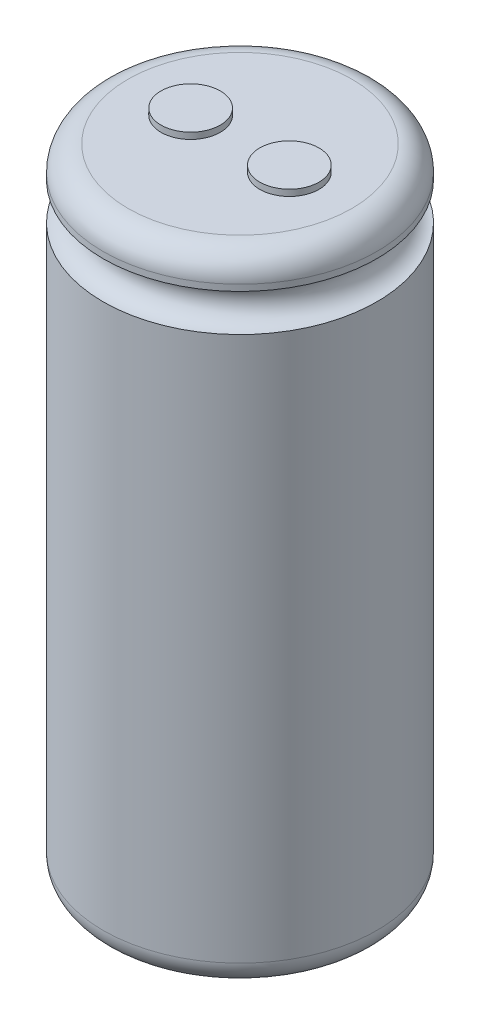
ISO-10303-21;
HEADER;
FILE_DESCRIPTION(('STEP AP214'),'2;1');
FILE_NAME('part.step','',(''),(''),'','','');
FILE_SCHEMA(('AUTOMOTIVE_DESIGN { 1 0 10303 214 1 1 1 1 }'));
ENDSEC;
DATA;
#1=APPLICATION_CONTEXT('core data for automotive mechanical design processes');
#2=APPLICATION_PROTOCOL_DEFINITION('international standard','automotive_design',2000,#1);
#3=PRODUCT_CONTEXT('',#1,'mechanical');
#4=PRODUCT('Part','Part','',(#3));
#5=PRODUCT_RELATED_PRODUCT_CATEGORY('part','',(#4));
#6=PRODUCT_DEFINITION_FORMATION('','',#4);
#7=PRODUCT_DEFINITION_CONTEXT('part definition',#1,'design');
#8=PRODUCT_DEFINITION('design','',#6,#7);
#9=PRODUCT_DEFINITION_SHAPE('','',#8);
#10=(LENGTH_UNIT() NAMED_UNIT(*) SI_UNIT(.MILLI.,.METRE.));
#11=(NAMED_UNIT(*) PLANE_ANGLE_UNIT() SI_UNIT($,.RADIAN.));
#12=(NAMED_UNIT(*) SI_UNIT($,.STERADIAN.) SOLID_ANGLE_UNIT());
#13=UNCERTAINTY_MEASURE_WITH_UNIT(LENGTH_MEASURE(1.E-05),#10,'distance_accuracy_value','');
#14=(GEOMETRIC_REPRESENTATION_CONTEXT(3) GLOBAL_UNCERTAINTY_ASSIGNED_CONTEXT((#13)) GLOBAL_UNIT_ASSIGNED_CONTEXT((#10,
#11,#12)) REPRESENTATION_CONTEXT('',''));
#15=CARTESIAN_POINT('',(0.,0.,0.));
#16=DIRECTION('',(0.,0.,1.));
#17=DIRECTION('',(1.,0.,0.));
#18=AXIS2_PLACEMENT_3D('',#15,#16,#17);
#19=CARTESIAN_POINT('',(0.,51.2572,-9.));
#20=DIRECTION('',(0.,-1.,0.));
#21=DIRECTION('',(0.,0.,-1.));
#22=AXIS2_PLACEMENT_3D('',#19,#20,#21);
#23=PLANE('',#22);
#24=CARTESIAN_POINT('',(3.96875,51.2572,0.));
#25=DIRECTION('',(0.,-1.,0.));
#26=DIRECTION('',(0.,0.,-1.));
#27=AXIS2_PLACEMENT_3D('',#24,#25,#26);
#28=CIRCLE('',#27,2.38125);
#29=CARTESIAN_POINT('',(3.96875,51.2572,-2.38125));
#30=VERTEX_POINT('',#29);
#31=EDGE_CURVE('E10',#30,#30,#28,.F.);
#32=ORIENTED_EDGE('',*,*,#31,.F.);
#33=EDGE_LOOP('',(#32));
#34=FACE_BOUND('',#33,.T.);
#35=CARTESIAN_POINT('',(-3.96875,51.2572,0.));
#36=DIRECTION('',(0.,-1.,0.));
#37=DIRECTION('',(0.,0.,-1.));
#38=AXIS2_PLACEMENT_3D('',#35,#36,#37);
#39=CIRCLE('',#38,2.38125);
#40=CARTESIAN_POINT('',(-3.96875,51.2572,-2.38125));
#41=VERTEX_POINT('',#40);
#42=EDGE_CURVE('E43',#41,#41,#39,.F.);
#43=ORIENTED_EDGE('',*,*,#42,.F.);
#44=EDGE_LOOP('',(#43));
#45=FACE_BOUND('',#44,.T.);
#46=CARTESIAN_POINT('',(0.,51.2572,0.));
#47=DIRECTION('',(0.,1.,0.));
#48=DIRECTION('',(0.,0.,1.));
#49=AXIS2_PLACEMENT_3D('',#46,#47,#48);
#50=CIRCLE('',#49,9.);
#51=CARTESIAN_POINT('',(0.,51.2572,9.));
#52=VERTEX_POINT('',#51);
#53=EDGE_CURVE('E49',#52,#52,#50,.T.);
#54=ORIENTED_EDGE('',*,*,#53,.T.);
#55=EDGE_LOOP('',(#54));
#56=FACE_BOUND('',#55,.T.);
#57=ADVANCED_FACE('F36',(#34,#45,#56),#23,.F.);
#58=CARTESIAN_POINT('',(0.,49.2572,0.));
#59=DIRECTION('',(0.,1.,0.));
#60=DIRECTION('',(0.,0.,1.));
#61=AXIS2_PLACEMENT_3D('',#58,#59,#60);
#62=TOROIDAL_SURFACE('',#61,9.,2.);
#63=ORIENTED_EDGE('',*,*,#53,.F.);
#64=EDGE_LOOP('',(#63));
#65=FACE_BOUND('',#64,.T.);
#66=CARTESIAN_POINT('',(0.,49.2572,0.));
#67=DIRECTION('',(0.,1.,0.));
#68=DIRECTION('',(0.,0.,1.));
#69=AXIS2_PLACEMENT_3D('',#66,#67,#68);
#70=CIRCLE('',#69,11.);
#71=CARTESIAN_POINT('',(0.,49.2572,11.));
#72=VERTEX_POINT('',#71);
#73=EDGE_CURVE('E53',#72,#72,#70,.T.);
#74=ORIENTED_EDGE('',*,*,#73,.T.);
#75=EDGE_LOOP('',(#74));
#76=FACE_BOUND('',#75,.T.);
#77=ADVANCED_FACE('F95',(#65,#76),#62,.T.);
#78=CARTESIAN_POINT('',(0.,51.2572,0.));
#79=DIRECTION('',(0.,1.,0.));
#80=DIRECTION('',(0.,0.,1.));
#81=AXIS2_PLACEMENT_3D('',#78,#79,#80);
#82=CYLINDRICAL_SURFACE('',#81,11.);
#83=ORIENTED_EDGE('',*,*,#73,.F.);
#84=EDGE_LOOP('',(#83));
#85=FACE_BOUND('',#84,.T.);
#86=CARTESIAN_POINT('',(0.,48.7572,0.));
#87=DIRECTION('',(0.,1.,0.));
#88=DIRECTION('',(0.,0.,1.));
#89=AXIS2_PLACEMENT_3D('',#86,#87,#88);
#90=CIRCLE('',#89,11.);
#91=CARTESIAN_POINT('',(0.,48.7572,11.));
#92=VERTEX_POINT('',#91);
#93=EDGE_CURVE('E59',#92,#92,#90,.T.);
#94=ORIENTED_EDGE('',*,*,#93,.T.);
#95=EDGE_LOOP('',(#94));
#96=FACE_BOUND('',#95,.T.);
#97=ADVANCED_FACE('F100',(#85,#96),#82,.T.);
#98=CARTESIAN_POINT('',(0.,47.2572,0.));
#99=DIRECTION('',(0.,1.,0.));
#100=DIRECTION('',(0.,0.,1.));
#101=AXIS2_PLACEMENT_3D('',#98,#99,#100);
#102=TOROIDAL_SURFACE('',#101,11.,1.5);
#103=ORIENTED_EDGE('',*,*,#93,.F.);
#104=EDGE_LOOP('',(#103));
#105=FACE_BOUND('',#104,.T.);
#106=CARTESIAN_POINT('',(0.,45.7572,0.));
#107=DIRECTION('',(0.,1.,0.));
#108=DIRECTION('',(0.,0.,1.));
#109=AXIS2_PLACEMENT_3D('',#106,#107,#108);
#110=CIRCLE('',#109,11.);
#111=CARTESIAN_POINT('',(0.,45.7572,11.));
#112=VERTEX_POINT('',#111);
#113=EDGE_CURVE('E63',#112,#112,#110,.T.);
#114=ORIENTED_EDGE('',*,*,#113,.T.);
#115=EDGE_LOOP('',(#114));
#116=FACE_BOUND('',#115,.T.);
#117=ADVANCED_FACE('F110',(#105,#116),#102,.F.);
#118=CARTESIAN_POINT('',(0.,51.2572,0.));
#119=DIRECTION('',(0.,1.,0.));
#120=DIRECTION('',(0.,0.,1.));
#121=AXIS2_PLACEMENT_3D('',#118,#119,#120);
#122=CYLINDRICAL_SURFACE('',#121,11.);
#123=ORIENTED_EDGE('',*,*,#113,.F.);
#124=EDGE_LOOP('',(#123));
#125=FACE_BOUND('',#124,.T.);
#126=CARTESIAN_POINT('',(0.,2.,0.));
#127=DIRECTION('',(0.,1.,0.));
#128=DIRECTION('',(0.,0.,1.));
#129=AXIS2_PLACEMENT_3D('',#126,#127,#128);
#130=CIRCLE('',#129,11.);
#131=CARTESIAN_POINT('',(0.,2.,11.));
#132=VERTEX_POINT('',#131);
#133=EDGE_CURVE('E67',#132,#132,#130,.T.);
#134=ORIENTED_EDGE('',*,*,#133,.T.);
#135=EDGE_LOOP('',(#134));
#136=FACE_BOUND('',#135,.T.);
#137=ADVANCED_FACE('F116',(#125,#136),#122,.T.);
#138=CARTESIAN_POINT('',(0.,2.,0.));
#139=DIRECTION('',(0.,1.,0.));
#140=DIRECTION('',(0.,0.,1.));
#141=AXIS2_PLACEMENT_3D('',#138,#139,#140);
#142=TOROIDAL_SURFACE('',#141,9.00000000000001,2.);
#143=ORIENTED_EDGE('',*,*,#133,.F.);
#144=EDGE_LOOP('',(#143));
#145=FACE_BOUND('',#144,.T.);
#146=CARTESIAN_POINT('',(0.,0.,0.));
#147=DIRECTION('',(0.,1.,0.));
#148=DIRECTION('',(0.,0.,1.));
#149=AXIS2_PLACEMENT_3D('',#146,#147,#148);
#150=CIRCLE('',#149,9.00000000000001);
#151=CARTESIAN_POINT('',(0.,0.,9.00000000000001));
#152=VERTEX_POINT('',#151);
#153=EDGE_CURVE('E70',#152,#152,#150,.T.);
#154=ORIENTED_EDGE('',*,*,#153,.T.);
#155=EDGE_LOOP('',(#154));
#156=FACE_BOUND('',#155,.T.);
#157=ADVANCED_FACE('F122',(#145,#156),#142,.T.);
#158=CARTESIAN_POINT('',(0.,0.,0.));
#159=DIRECTION('',(0.,1.,0.));
#160=DIRECTION('',(0.,0.,1.));
#161=AXIS2_PLACEMENT_3D('',#158,#159,#160);
#162=PLANE('',#161);
#163=ORIENTED_EDGE('',*,*,#153,.F.);
#164=EDGE_LOOP('',(#163));
#165=FACE_BOUND('',#164,.T.);
#166=ADVANCED_FACE('F128',(#165),#162,.F.);
#167=CARTESIAN_POINT('',(-3.96875,51.7652,0.));
#168=DIRECTION('',(0.,-1.,0.));
#169=DIRECTION('',(0.,0.,-1.));
#170=AXIS2_PLACEMENT_3D('',#167,#168,#169);
#171=CYLINDRICAL_SURFACE('',#170,2.38125);
#172=CARTESIAN_POINT('',(-3.96875,51.7652,0.));
#173=DIRECTION('',(0.,1.,0.));
#174=DIRECTION('',(0.,0.,1.));
#175=AXIS2_PLACEMENT_3D('',#172,#173,#174);
#176=CIRCLE('',#175,2.38125);
#177=CARTESIAN_POINT('',(-3.96875,51.7652,2.38125));
#178=VERTEX_POINT('',#177);
#179=EDGE_CURVE('E73',#178,#178,#176,.T.);
#180=ORIENTED_EDGE('',*,*,#179,.F.);
#181=EDGE_LOOP('',(#180));
#182=FACE_BOUND('',#181,.T.);
#183=ORIENTED_EDGE('',*,*,#42,.T.);
#184=EDGE_LOOP('',(#183));
#185=FACE_BOUND('',#184,.T.);
#186=ADVANCED_FACE('F91',(#182,#185),#171,.T.);
#187=CARTESIAN_POINT('',(-3.96875,51.7652,0.));
#188=DIRECTION('',(0.,1.,0.));
#189=DIRECTION('',(0.,0.,1.));
#190=AXIS2_PLACEMENT_3D('',#187,#188,#189);
#191=PLANE('',#190);
#192=ORIENTED_EDGE('',*,*,#179,.T.);
#193=EDGE_LOOP('',(#192));
#194=FACE_BOUND('',#193,.T.);
#195=ADVANCED_FACE('F84',(#194),#191,.T.);
#196=CARTESIAN_POINT('',(3.96875,51.7652,0.));
#197=DIRECTION('',(0.,-1.,0.));
#198=DIRECTION('',(0.,0.,-1.));
#199=AXIS2_PLACEMENT_3D('',#196,#197,#198);
#200=CYLINDRICAL_SURFACE('',#199,2.38125);
#201=CARTESIAN_POINT('',(3.96875,51.7652,0.));
#202=DIRECTION('',(0.,1.,0.));
#203=DIRECTION('',(0.,0.,1.));
#204=AXIS2_PLACEMENT_3D('',#201,#202,#203);
#205=CIRCLE('',#204,2.38125);
#206=CARTESIAN_POINT('',(3.96875,51.7652,2.38125));
#207=VERTEX_POINT('',#206);
#208=EDGE_CURVE('E76',#207,#207,#205,.T.);
#209=ORIENTED_EDGE('',*,*,#208,.F.);
#210=EDGE_LOOP('',(#209));
#211=FACE_BOUND('',#210,.T.);
#212=ORIENTED_EDGE('',*,*,#31,.T.);
#213=EDGE_LOOP('',(#212));
#214=FACE_BOUND('',#213,.T.);
#215=ADVANCED_FACE('F82',(#211,#214),#200,.T.);
#216=CARTESIAN_POINT('',(3.96875,51.7652,0.));
#217=DIRECTION('',(0.,1.,0.));
#218=DIRECTION('',(0.,0.,1.));
#219=AXIS2_PLACEMENT_3D('',#216,#217,#218);
#220=PLANE('',#219);
#221=ORIENTED_EDGE('',*,*,#208,.T.);
#222=EDGE_LOOP('',(#221));
#223=FACE_BOUND('',#222,.T.);
#224=ADVANCED_FACE('F80',(#223),#220,.T.);
#225=CLOSED_SHELL('',(#57,#77,#97,#117,#137,#157,#166,#186,#195,#215,#224));
#226=MANIFOLD_SOLID_BREP('B2',#225);
#227=ADVANCED_BREP_SHAPE_REPRESENTATION('',(#18,#226),#14);
#228=SHAPE_DEFINITION_REPRESENTATION(#9,#227);
ENDSEC;
END-ISO-10303-21;
